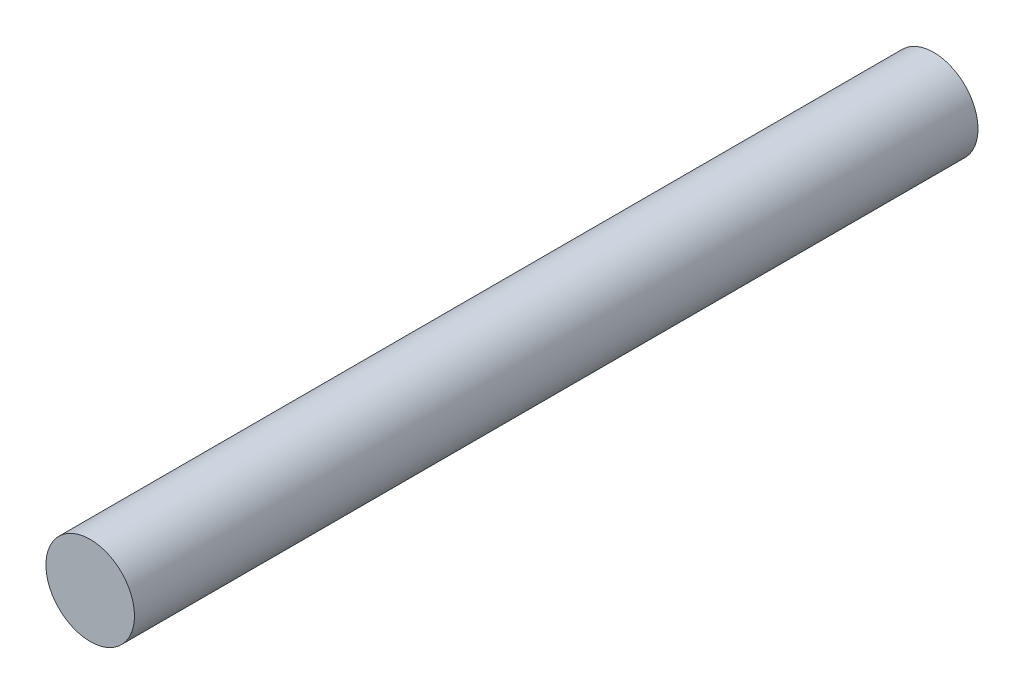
from build123d import *

# Parameters (mm, degrees)
SKETCH1_R           = 52.5
BOSS_EXTRUDE1_DEPTH = 1000


with BuildPart() as part:
    # Sketch1 → Boss-Extrude1 (new body)
    with BuildSketch(Plane.XY):
        Circle(SKETCH1_R)
    extrude(amount=BOSS_EXTRUDE1_DEPTH)


solid = part.part
